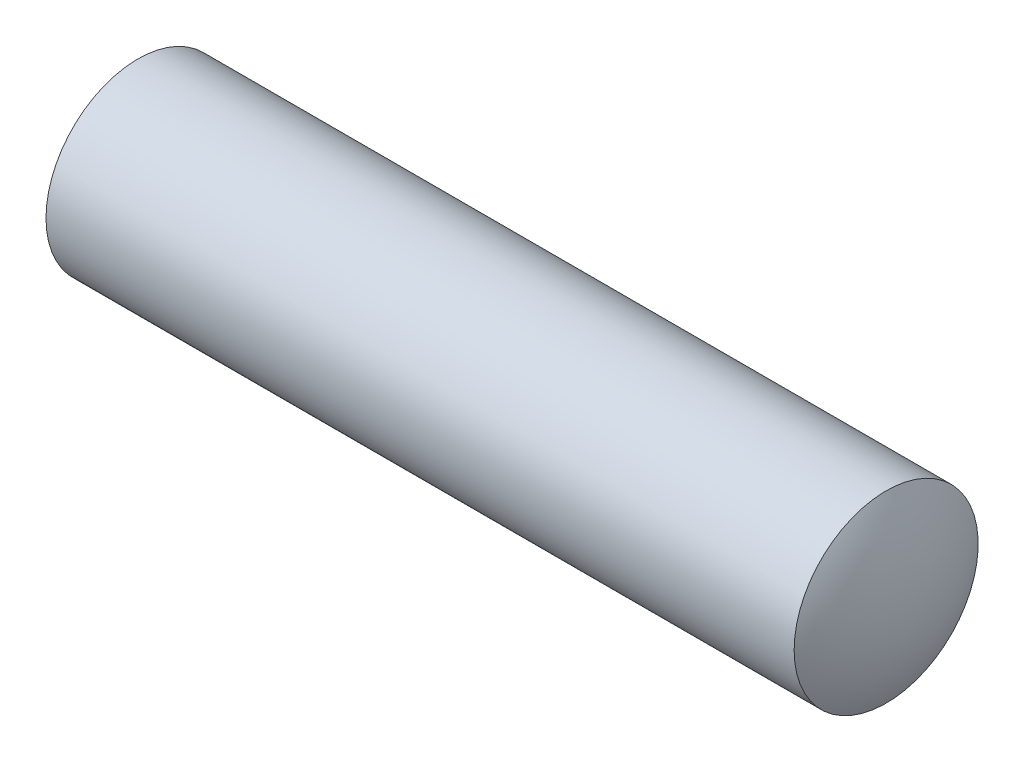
from build123d import *


with BuildPart() as part:
    # Esquisse1 → Base-R_volution (revolve)
    with BuildSketch(Plane.XY, mode=Mode.PRIVATE) as base_r_volution_sk:
        with BuildLine():
            Line((0.803847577, 3), (25.196152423, 3))
            ThreePointArc((25.196152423, 3), (25.795554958, 1.552914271), (26, 0))
            Line((26, 0), (0, 0))
            ThreePointArc((0, 0), (0.204445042, 1.552914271), (0.803847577, 3))
        make_face()
    revolve(base_r_volution_sk.sketch.rotate(Axis((0, 0, 0), (1, 0, 0)), 90), axis=Axis((0, 0, 0), (1, 0, 0)))


solid = part.part
